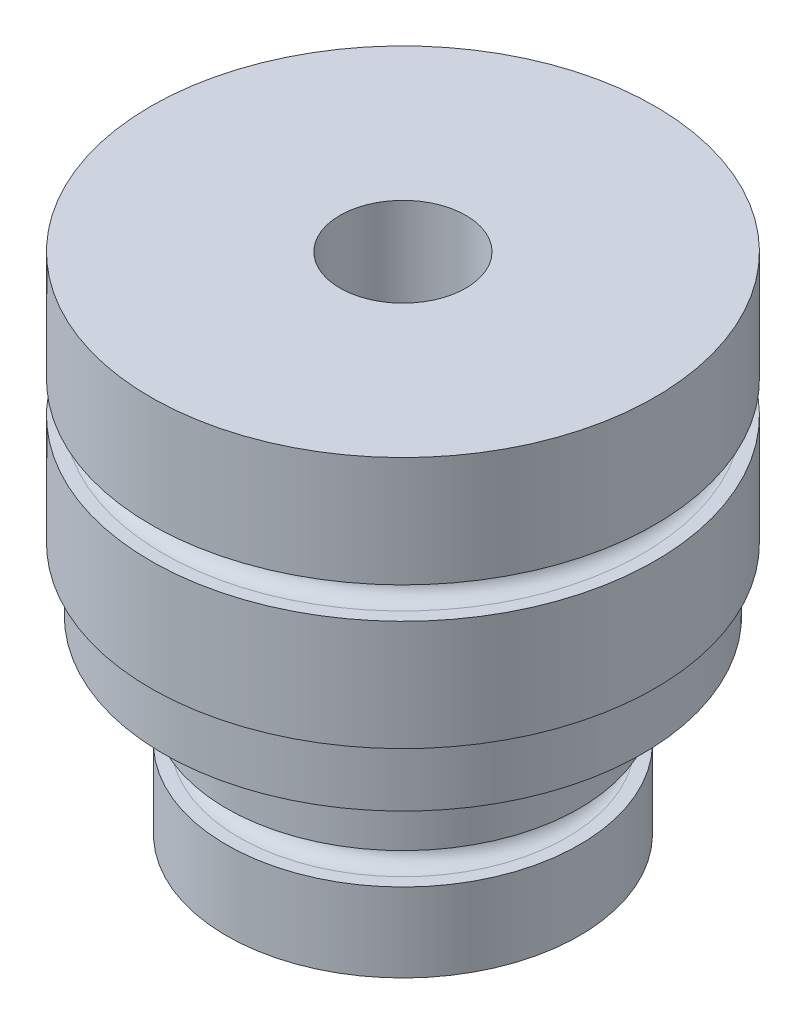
ISO-10303-21;
HEADER;
FILE_DESCRIPTION(('STEP AP214'),'2;1');
FILE_NAME('part.step','',(''),(''),'','','');
FILE_SCHEMA(('AUTOMOTIVE_DESIGN { 1 0 10303 214 1 1 1 1 }'));
ENDSEC;
DATA;
#1=APPLICATION_CONTEXT('core data for automotive mechanical design processes');
#2=APPLICATION_PROTOCOL_DEFINITION('international standard','automotive_design',2000,#1);
#3=PRODUCT_CONTEXT('',#1,'mechanical');
#4=PRODUCT('Part','Part','',(#3));
#5=PRODUCT_RELATED_PRODUCT_CATEGORY('part','',(#4));
#6=PRODUCT_DEFINITION_FORMATION('','',#4);
#7=PRODUCT_DEFINITION_CONTEXT('part definition',#1,'design');
#8=PRODUCT_DEFINITION('design','',#6,#7);
#9=PRODUCT_DEFINITION_SHAPE('','',#8);
#10=(LENGTH_UNIT() NAMED_UNIT(*) SI_UNIT(.MILLI.,.METRE.));
#11=(NAMED_UNIT(*) PLANE_ANGLE_UNIT() SI_UNIT($,.RADIAN.));
#12=(NAMED_UNIT(*) SI_UNIT($,.STERADIAN.) SOLID_ANGLE_UNIT());
#13=UNCERTAINTY_MEASURE_WITH_UNIT(LENGTH_MEASURE(1.E-05),#10,'distance_accuracy_value','');
#14=(GEOMETRIC_REPRESENTATION_CONTEXT(3) GLOBAL_UNCERTAINTY_ASSIGNED_CONTEXT((#13)) GLOBAL_UNIT_ASSIGNED_CONTEXT((#10,
#11,#12)) REPRESENTATION_CONTEXT('',''));
#15=CARTESIAN_POINT('',(0.,0.,0.));
#16=DIRECTION('',(0.,0.,1.));
#17=DIRECTION('',(1.,0.,0.));
#18=AXIS2_PLACEMENT_3D('',#15,#16,#17);
#19=CARTESIAN_POINT('',(5.,2.9585602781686,0.));
#20=DIRECTION('',(0.,1.,0.));
#21=DIRECTION('',(-1.,0.,0.));
#22=AXIS2_PLACEMENT_3D('',#19,#20,#21);
#23=CYLINDRICAL_SURFACE('',#22,5.00000000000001);
#24=CARTESIAN_POINT('',(5.,0.,0.));
#25=DIRECTION('',(0.,1.,0.));
#26=DIRECTION('',(-1.,0.,0.));
#27=AXIS2_PLACEMENT_3D('',#24,#25,#26);
#28=CIRCLE('',#27,5.);
#29=CARTESIAN_POINT('',(0.,0.,0.));
#30=VERTEX_POINT('',#29);
#31=EDGE_CURVE('E88',#30,#30,#28,.T.);
#32=ORIENTED_EDGE('',*,*,#31,.T.);
#33=EDGE_LOOP('',(#32));
#34=FACE_BOUND('',#33,.T.);
#35=CARTESIAN_POINT('',(5.00000000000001,-38.,0.));
#36=DIRECTION('',(0.,1.,0.));
#37=DIRECTION('',(-1.,0.,0.));
#38=AXIS2_PLACEMENT_3D('',#35,#36,#37);
#39=CIRCLE('',#38,5.00000000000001);
#40=CARTESIAN_POINT('',(0.,-38.,0.));
#41=VERTEX_POINT('',#40);
#42=EDGE_CURVE('E10',#41,#41,#39,.T.);
#43=ORIENTED_EDGE('',*,*,#42,.F.);
#44=EDGE_LOOP('',(#43));
#45=FACE_BOUND('',#44,.T.);
#46=ADVANCED_FACE('F33',(#34,#45),#23,.F.);
#47=CARTESIAN_POINT('',(5.00000000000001,-40.,0.));
#48=DIRECTION('',(0.,-1.,0.));
#49=DIRECTION('',(1.,0.,0.));
#50=AXIS2_PLACEMENT_3D('',#47,#48,#49);
#51=CONICAL_SURFACE('',#50,7.,0.785398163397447);
#52=ORIENTED_EDGE('',*,*,#42,.T.);
#53=EDGE_LOOP('',(#52));
#54=FACE_BOUND('',#53,.T.);
#55=CARTESIAN_POINT('',(5.00000000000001,-40.,0.));
#56=DIRECTION('',(0.,1.,0.));
#57=DIRECTION('',(-1.,0.,0.));
#58=AXIS2_PLACEMENT_3D('',#55,#56,#57);
#59=CIRCLE('',#58,7.);
#60=CARTESIAN_POINT('',(-1.99999999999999,-40.,0.));
#61=VERTEX_POINT('',#60);
#62=EDGE_CURVE('E39',#61,#61,#59,.T.);
#63=ORIENTED_EDGE('',*,*,#62,.F.);
#64=EDGE_LOOP('',(#63));
#65=FACE_BOUND('',#64,.T.);
#66=ADVANCED_FACE('F106',(#54,#65),#51,.F.);
#67=CARTESIAN_POINT('',(-9.,-40.,0.));
#68=DIRECTION('',(0.,-1.,0.));
#69=DIRECTION('',(1.,0.,0.));
#70=AXIS2_PLACEMENT_3D('',#67,#68,#69);
#71=PLANE('',#70);
#72=ORIENTED_EDGE('',*,*,#62,.T.);
#73=EDGE_LOOP('',(#72));
#74=FACE_BOUND('',#73,.T.);
#75=CARTESIAN_POINT('',(5.00000000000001,-40.,0.));
#76=DIRECTION('',(0.,1.,0.));
#77=DIRECTION('',(-1.,0.,0.));
#78=AXIS2_PLACEMENT_3D('',#75,#76,#77);
#79=CIRCLE('',#78,14.);
#80=CARTESIAN_POINT('',(-9.,-40.,0.));
#81=VERTEX_POINT('',#80);
#82=EDGE_CURVE('E43',#81,#81,#79,.T.);
#83=ORIENTED_EDGE('',*,*,#82,.F.);
#84=EDGE_LOOP('',(#83));
#85=FACE_BOUND('',#84,.T.);
#86=ADVANCED_FACE('F110',(#74,#85),#71,.T.);
#87=CARTESIAN_POINT('',(5.,2.9585602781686,0.));
#88=DIRECTION('',(0.,1.,0.));
#89=DIRECTION('',(-1.,0.,0.));
#90=AXIS2_PLACEMENT_3D('',#87,#88,#89);
#91=CYLINDRICAL_SURFACE('',#90,14.);
#92=ORIENTED_EDGE('',*,*,#82,.T.);
#93=EDGE_LOOP('',(#92));
#94=FACE_BOUND('',#93,.T.);
#95=CARTESIAN_POINT('',(5.00000000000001,-33.75,0.));
#96=DIRECTION('',(0.,1.,0.));
#97=DIRECTION('',(-1.,0.,0.));
#98=AXIS2_PLACEMENT_3D('',#95,#96,#97);
#99=CIRCLE('',#98,14.);
#100=CARTESIAN_POINT('',(-8.99999999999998,-33.75,0.));
#101=VERTEX_POINT('',#100);
#102=EDGE_CURVE('E47',#101,#101,#99,.T.);
#103=ORIENTED_EDGE('',*,*,#102,.F.);
#104=EDGE_LOOP('',(#103));
#105=FACE_BOUND('',#104,.T.);
#106=ADVANCED_FACE('F114',(#94,#105),#91,.T.);
#107=CARTESIAN_POINT('',(-8.99999999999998,-33.75,0.));
#108=DIRECTION('',(0.,1.,0.));
#109=DIRECTION('',(-1.,0.,0.));
#110=AXIS2_PLACEMENT_3D('',#107,#108,#109);
#111=PLANE('',#110);
#112=ORIENTED_EDGE('',*,*,#102,.T.);
#113=EDGE_LOOP('',(#112));
#114=FACE_BOUND('',#113,.T.);
#115=CARTESIAN_POINT('',(5.00000000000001,-33.75,0.));
#116=DIRECTION('',(0.,1.,0.));
#117=DIRECTION('',(-1.,0.,0.));
#118=AXIS2_PLACEMENT_3D('',#115,#116,#117);
#119=CIRCLE('',#118,13.);
#120=CARTESIAN_POINT('',(-8.,-33.75,0.));
#121=VERTEX_POINT('',#120);
#122=EDGE_CURVE('E52',#121,#121,#119,.T.);
#123=ORIENTED_EDGE('',*,*,#122,.F.);
#124=EDGE_LOOP('',(#123));
#125=FACE_BOUND('',#124,.T.);
#126=ADVANCED_FACE('F120',(#114,#125),#111,.T.);
#127=CARTESIAN_POINT('',(5.00000000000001,-32.5,0.));
#128=DIRECTION('',(0.,1.,0.));
#129=DIRECTION('',(-1.,0.,0.));
#130=AXIS2_PLACEMENT_3D('',#127,#128,#129);
#131=TOROIDAL_SURFACE('',#130,13.,1.25);
#132=ORIENTED_EDGE('',*,*,#122,.T.);
#133=EDGE_LOOP('',(#132));
#134=FACE_BOUND('',#133,.T.);
#135=CARTESIAN_POINT('',(5.00000000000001,-31.25,0.));
#136=DIRECTION('',(0.,1.,0.));
#137=DIRECTION('',(-1.,0.,0.));
#138=AXIS2_PLACEMENT_3D('',#135,#136,#137);
#139=CIRCLE('',#138,13.);
#140=CARTESIAN_POINT('',(-8.,-31.25,0.));
#141=VERTEX_POINT('',#140);
#142=EDGE_CURVE('E55',#141,#141,#139,.T.);
#143=ORIENTED_EDGE('',*,*,#142,.F.);
#144=EDGE_LOOP('',(#143));
#145=FACE_BOUND('',#144,.T.);
#146=ADVANCED_FACE('F124',(#134,#145),#131,.F.);
#147=CARTESIAN_POINT('',(-9.,-31.25,0.));
#148=DIRECTION('',(0.,-1.,0.));
#149=DIRECTION('',(1.,0.,0.));
#150=AXIS2_PLACEMENT_3D('',#147,#148,#149);
#151=PLANE('',#150);
#152=ORIENTED_EDGE('',*,*,#142,.T.);
#153=EDGE_LOOP('',(#152));
#154=FACE_BOUND('',#153,.T.);
#155=CARTESIAN_POINT('',(5.00000000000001,-31.25,0.));
#156=DIRECTION('',(0.,1.,0.));
#157=DIRECTION('',(-1.,0.,0.));
#158=AXIS2_PLACEMENT_3D('',#155,#156,#157);
#159=CIRCLE('',#158,14.);
#160=CARTESIAN_POINT('',(-9.,-31.25,0.));
#161=VERTEX_POINT('',#160);
#162=EDGE_CURVE('E58',#161,#161,#159,.T.);
#163=ORIENTED_EDGE('',*,*,#162,.F.);
#164=EDGE_LOOP('',(#163));
#165=FACE_BOUND('',#164,.T.);
#166=ADVANCED_FACE('F128',(#154,#165),#151,.T.);
#167=CARTESIAN_POINT('',(5.,2.9585602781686,0.));
#168=DIRECTION('',(0.,1.,0.));
#169=DIRECTION('',(-1.,0.,0.));
#170=AXIS2_PLACEMENT_3D('',#167,#168,#169);
#171=CYLINDRICAL_SURFACE('',#170,14.);
#172=ORIENTED_EDGE('',*,*,#162,.T.);
#173=EDGE_LOOP('',(#172));
#174=FACE_BOUND('',#173,.T.);
#175=CARTESIAN_POINT('',(5.00000000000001,-25.,0.));
#176=DIRECTION('',(0.,1.,0.));
#177=DIRECTION('',(-1.,0.,0.));
#178=AXIS2_PLACEMENT_3D('',#175,#176,#177);
#179=CIRCLE('',#178,14.);
#180=CARTESIAN_POINT('',(-9.,-25.,0.));
#181=VERTEX_POINT('',#180);
#182=EDGE_CURVE('E61',#181,#181,#179,.T.);
#183=ORIENTED_EDGE('',*,*,#182,.F.);
#184=EDGE_LOOP('',(#183));
#185=FACE_BOUND('',#184,.T.);
#186=ADVANCED_FACE('F132',(#174,#185),#171,.T.);
#187=CARTESIAN_POINT('',(-14.,-25.,0.));
#188=DIRECTION('',(0.,-1.,0.));
#189=DIRECTION('',(1.,0.,0.));
#190=AXIS2_PLACEMENT_3D('',#187,#188,#189);
#191=PLANE('',#190);
#192=ORIENTED_EDGE('',*,*,#182,.T.);
#193=EDGE_LOOP('',(#192));
#194=FACE_BOUND('',#193,.T.);
#195=CARTESIAN_POINT('',(5.00000000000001,-25.,0.));
#196=DIRECTION('',(0.,1.,0.));
#197=DIRECTION('',(-1.,0.,0.));
#198=AXIS2_PLACEMENT_3D('',#195,#196,#197);
#199=CIRCLE('',#198,19.);
#200=CARTESIAN_POINT('',(-14.,-25.,0.));
#201=VERTEX_POINT('',#200);
#202=EDGE_CURVE('E64',#201,#201,#199,.T.);
#203=ORIENTED_EDGE('',*,*,#202,.F.);
#204=EDGE_LOOP('',(#203));
#205=FACE_BOUND('',#204,.T.);
#206=ADVANCED_FACE('F136',(#194,#205),#191,.T.);
#207=CARTESIAN_POINT('',(5.,2.9585602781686,0.));
#208=DIRECTION('',(0.,1.,0.));
#209=DIRECTION('',(-1.,0.,0.));
#210=AXIS2_PLACEMENT_3D('',#207,#208,#209);
#211=CYLINDRICAL_SURFACE('',#210,19.);
#212=ORIENTED_EDGE('',*,*,#202,.T.);
#213=EDGE_LOOP('',(#212));
#214=FACE_BOUND('',#213,.T.);
#215=CARTESIAN_POINT('',(5.00000000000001,-20.,0.));
#216=DIRECTION('',(0.,1.,0.));
#217=DIRECTION('',(-1.,0.,0.));
#218=AXIS2_PLACEMENT_3D('',#215,#216,#217);
#219=CIRCLE('',#218,19.);
#220=CARTESIAN_POINT('',(-14.,-20.,0.));
#221=VERTEX_POINT('',#220);
#222=EDGE_CURVE('E67',#221,#221,#219,.T.);
#223=ORIENTED_EDGE('',*,*,#222,.F.);
#224=EDGE_LOOP('',(#223));
#225=FACE_BOUND('',#224,.T.);
#226=ADVANCED_FACE('F140',(#214,#225),#211,.T.);
#227=CARTESIAN_POINT('',(-15.,-20.,0.));
#228=DIRECTION('',(0.,-1.,0.));
#229=DIRECTION('',(1.,0.,0.));
#230=AXIS2_PLACEMENT_3D('',#227,#228,#229);
#231=PLANE('',#230);
#232=ORIENTED_EDGE('',*,*,#222,.T.);
#233=EDGE_LOOP('',(#232));
#234=FACE_BOUND('',#233,.T.);
#235=CARTESIAN_POINT('',(5.00000000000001,-20.,0.));
#236=DIRECTION('',(0.,1.,0.));
#237=DIRECTION('',(-1.,0.,0.));
#238=AXIS2_PLACEMENT_3D('',#235,#236,#237);
#239=CIRCLE('',#238,20.);
#240=CARTESIAN_POINT('',(-15.,-20.,0.));
#241=VERTEX_POINT('',#240);
#242=EDGE_CURVE('E70',#241,#241,#239,.T.);
#243=ORIENTED_EDGE('',*,*,#242,.F.);
#244=EDGE_LOOP('',(#243));
#245=FACE_BOUND('',#244,.T.);
#246=ADVANCED_FACE('F144',(#234,#245),#231,.T.);
#247=CARTESIAN_POINT('',(5.,2.9585602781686,0.));
#248=DIRECTION('',(0.,1.,0.));
#249=DIRECTION('',(-1.,0.,0.));
#250=AXIS2_PLACEMENT_3D('',#247,#248,#249);
#251=CYLINDRICAL_SURFACE('',#250,20.);
#252=ORIENTED_EDGE('',*,*,#242,.T.);
#253=EDGE_LOOP('',(#252));
#254=FACE_BOUND('',#253,.T.);
#255=CARTESIAN_POINT('',(5.,-11.25,0.));
#256=DIRECTION('',(0.,1.,0.));
#257=DIRECTION('',(-1.,0.,0.));
#258=AXIS2_PLACEMENT_3D('',#255,#256,#257);
#259=CIRCLE('',#258,20.);
#260=CARTESIAN_POINT('',(-15.,-11.25,0.));
#261=VERTEX_POINT('',#260);
#262=EDGE_CURVE('E73',#261,#261,#259,.T.);
#263=ORIENTED_EDGE('',*,*,#262,.F.);
#264=EDGE_LOOP('',(#263));
#265=FACE_BOUND('',#264,.T.);
#266=ADVANCED_FACE('F148',(#254,#265),#251,.T.);
#267=CARTESIAN_POINT('',(-14.,-11.25,0.));
#268=DIRECTION('',(0.,1.,0.));
#269=DIRECTION('',(-1.,0.,0.));
#270=AXIS2_PLACEMENT_3D('',#267,#268,#269);
#271=PLANE('',#270);
#272=ORIENTED_EDGE('',*,*,#262,.T.);
#273=EDGE_LOOP('',(#272));
#274=FACE_BOUND('',#273,.T.);
#275=CARTESIAN_POINT('',(5.,-11.25,0.));
#276=DIRECTION('',(0.,1.,0.));
#277=DIRECTION('',(-1.,0.,0.));
#278=AXIS2_PLACEMENT_3D('',#275,#276,#277);
#279=CIRCLE('',#278,19.);
#280=CARTESIAN_POINT('',(-14.,-11.25,0.));
#281=VERTEX_POINT('',#280);
#282=EDGE_CURVE('E76',#281,#281,#279,.T.);
#283=ORIENTED_EDGE('',*,*,#282,.F.);
#284=EDGE_LOOP('',(#283));
#285=FACE_BOUND('',#284,.T.);
#286=ADVANCED_FACE('F152',(#274,#285),#271,.T.);
#287=CARTESIAN_POINT('',(5.,-10.,0.));
#288=DIRECTION('',(0.,1.,0.));
#289=DIRECTION('',(-1.,0.,0.));
#290=AXIS2_PLACEMENT_3D('',#287,#288,#289);
#291=TOROIDAL_SURFACE('',#290,19.,1.25);
#292=ORIENTED_EDGE('',*,*,#282,.T.);
#293=EDGE_LOOP('',(#292));
#294=FACE_BOUND('',#293,.T.);
#295=CARTESIAN_POINT('',(5.,-8.75000000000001,0.));
#296=DIRECTION('',(0.,1.,0.));
#297=DIRECTION('',(-1.,0.,0.));
#298=AXIS2_PLACEMENT_3D('',#295,#296,#297);
#299=CIRCLE('',#298,19.);
#300=CARTESIAN_POINT('',(-14.,-8.75000000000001,0.));
#301=VERTEX_POINT('',#300);
#302=EDGE_CURVE('E79',#301,#301,#299,.T.);
#303=ORIENTED_EDGE('',*,*,#302,.F.);
#304=EDGE_LOOP('',(#303));
#305=FACE_BOUND('',#304,.T.);
#306=ADVANCED_FACE('F156',(#294,#305),#291,.F.);
#307=CARTESIAN_POINT('',(-15.,-8.75000000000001,0.));
#308=DIRECTION('',(0.,-1.,0.));
#309=DIRECTION('',(1.,0.,0.));
#310=AXIS2_PLACEMENT_3D('',#307,#308,#309);
#311=PLANE('',#310);
#312=ORIENTED_EDGE('',*,*,#302,.T.);
#313=EDGE_LOOP('',(#312));
#314=FACE_BOUND('',#313,.T.);
#315=CARTESIAN_POINT('',(5.,-8.75,0.));
#316=DIRECTION('',(0.,1.,0.));
#317=DIRECTION('',(-1.,0.,0.));
#318=AXIS2_PLACEMENT_3D('',#315,#316,#317);
#319=CIRCLE('',#318,20.);
#320=CARTESIAN_POINT('',(-15.,-8.75000000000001,0.));
#321=VERTEX_POINT('',#320);
#322=EDGE_CURVE('E82',#321,#321,#319,.T.);
#323=ORIENTED_EDGE('',*,*,#322,.F.);
#324=EDGE_LOOP('',(#323));
#325=FACE_BOUND('',#324,.T.);
#326=ADVANCED_FACE('F102',(#314,#325),#311,.T.);
#327=CARTESIAN_POINT('',(5.,2.9585602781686,0.));
#328=DIRECTION('',(0.,1.,0.));
#329=DIRECTION('',(-1.,0.,0.));
#330=AXIS2_PLACEMENT_3D('',#327,#328,#329);
#331=CYLINDRICAL_SURFACE('',#330,20.);
#332=ORIENTED_EDGE('',*,*,#322,.T.);
#333=EDGE_LOOP('',(#332));
#334=FACE_BOUND('',#333,.T.);
#335=CARTESIAN_POINT('',(5.,0.,0.));
#336=DIRECTION('',(0.,1.,0.));
#337=DIRECTION('',(-1.,0.,0.));
#338=AXIS2_PLACEMENT_3D('',#335,#336,#337);
#339=CIRCLE('',#338,20.);
#340=CARTESIAN_POINT('',(-15.,0.,0.));
#341=VERTEX_POINT('',#340);
#342=EDGE_CURVE('E85',#341,#341,#339,.T.);
#343=ORIENTED_EDGE('',*,*,#342,.F.);
#344=EDGE_LOOP('',(#343));
#345=FACE_BOUND('',#344,.T.);
#346=ADVANCED_FACE('F96',(#334,#345),#331,.T.);
#347=CARTESIAN_POINT('',(0.,0.,0.));
#348=DIRECTION('',(0.,1.,0.));
#349=DIRECTION('',(-1.,0.,0.));
#350=AXIS2_PLACEMENT_3D('',#347,#348,#349);
#351=PLANE('',#350);
#352=ORIENTED_EDGE('',*,*,#342,.T.);
#353=EDGE_LOOP('',(#352));
#354=FACE_BOUND('',#353,.T.);
#355=ORIENTED_EDGE('',*,*,#31,.F.);
#356=EDGE_LOOP('',(#355));
#357=FACE_BOUND('',#356,.T.);
#358=ADVANCED_FACE('F94',(#354,#357),#351,.T.);
#359=CLOSED_SHELL('',(#46,#66,#86,#106,#126,#146,#166,#186,#206,#226,#246,#266,#286,#306,#326,
#346,#358));
#360=MANIFOLD_SOLID_BREP('B2',#359);
#361=ADVANCED_BREP_SHAPE_REPRESENTATION('',(#18,#360),#14);
#362=SHAPE_DEFINITION_REPRESENTATION(#9,#361);
ENDSEC;
END-ISO-10303-21;
